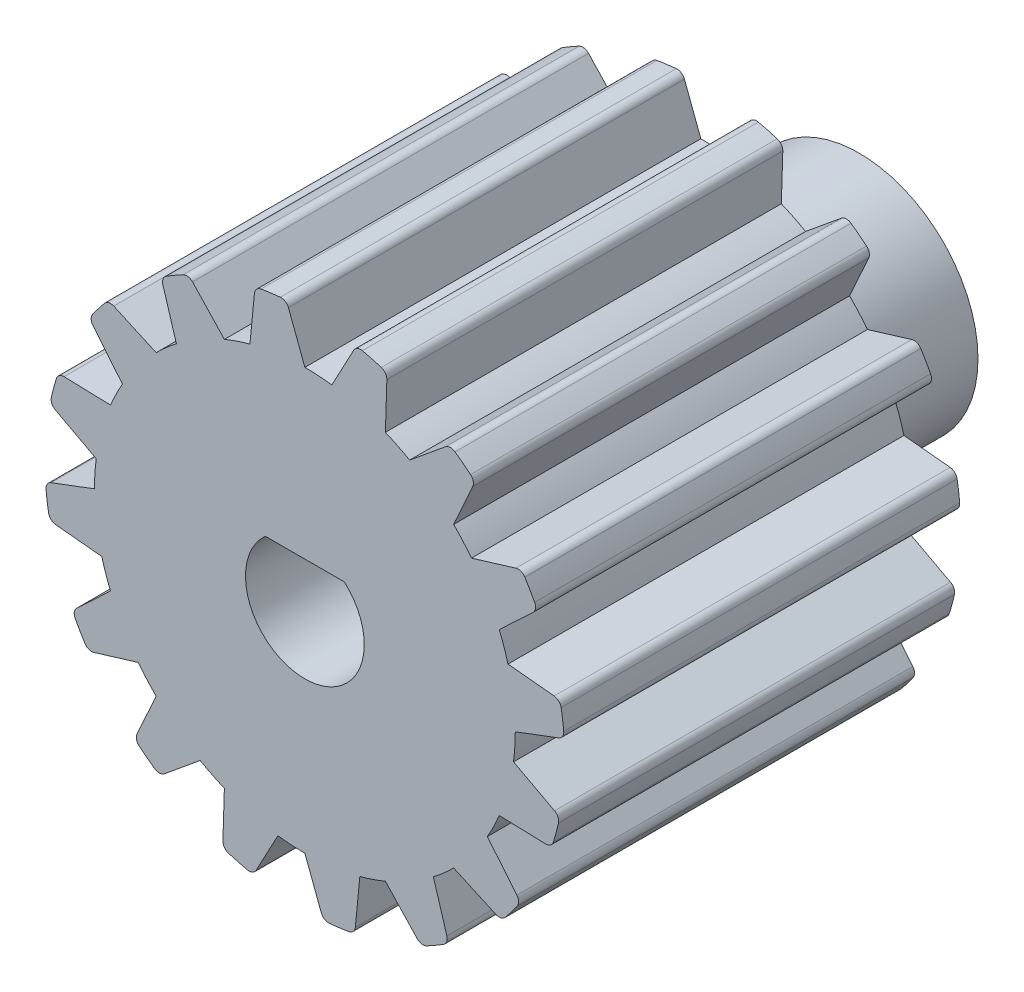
from build123d import *

# Parameters (mm, degrees)
SALIENTE_EXTRUIR1_DEPTH = 15
CROQUIS5_R              = 4.5
SALIENTE_EXTRUIR2_DEPTH = 6
CORTAR_EXTRUIR1_DEPTH   = 26.166810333


with BuildPart() as part:
    # Croquis2 → Saliente-Extruir1 (new body)
    with BuildSketch(Plane.XY):
        with BuildLine():
            Line((-2.081696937, 7.693567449), (-1.911179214, 9.445287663))
            ThreePointArc((-1.911179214, 9.445287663), (-1.831468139, 9.618345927), (-1.663611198, 9.708496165))
            ThreePointArc((-1.663611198, 9.708496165), (-1.297642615, 9.764149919), (-0.929841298, 9.806013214))
            ThreePointArc((-0.929841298, 9.806013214), (-0.744265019, 9.762833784), (-0.622120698, 9.616601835))
            Line((-0.622120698, 9.616601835), (0, 7.97022222))
            ThreePointArc((0, 7.97022222), (0.511536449, 7.953789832), (1.020963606, 7.904560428))
            Line((1.020963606, 7.904560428), (1.848855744, 9.457684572))
            ThreePointArc((1.848855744, 9.457684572), (1.988725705, 9.587065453), (2.1783043, 9.606117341))
            ThreePointArc((2.1783043, 9.606117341), (2.537712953, 9.517484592), (2.893537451, 9.415409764))
            ThreePointArc((2.893537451, 9.415409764), (3.048463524, 9.304500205), (3.105349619, 9.122656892))
            Line((3.105349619, 9.122656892), (3.050071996, 7.363525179))
            ThreePointArc((3.050071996, 7.363525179), (3.516381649, 7.152587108), (3.968191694, 6.912155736))
            Line((3.968191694, 6.912155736), (5.327419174, 8.030234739))
            ThreePointArc((5.327419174, 8.030234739), (5.506154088, 8.09624117), (5.688592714, 8.041294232))
            ThreePointArc((5.688592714, 8.041294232), (5.986724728, 7.821868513), (6.276401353, 7.591395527))
            ThreePointArc((6.276401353, 7.591395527), (6.37709113, 7.429640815), (6.360058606, 7.239870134))
            Line((6.360058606, 7.239870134), (5.635798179, 5.635798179))
            ThreePointArc((5.635798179, 5.635798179), (5.985889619, 5.262467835), (6.311298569, 4.867437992))
            Line((6.311298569, 4.867437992), (7.994931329, 5.380254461))
            ThreePointArc((7.994931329, 5.380254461), (8.185320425, 5.372837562), (8.332844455, 5.252256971))
            ThreePointArc((8.332844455, 5.252256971), (8.524311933, 4.935443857), (8.703740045, 4.611660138))
            ThreePointArc((8.703740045, 4.611660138), (8.73486442, 4.42368596), (8.646506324, 4.254878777))
            Line((8.646506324, 4.254878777), (7.363525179, 3.050071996))
            ThreePointArc((7.363525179, 3.050071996), (7.544100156, 2.571185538), (7.693567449, 2.081696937))
            Line((7.693567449, 2.081696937), (9.445287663, 1.911179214))
            ThreePointArc((9.445287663, 1.911179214), (9.618345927, 1.831468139), (9.708496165, 1.663611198))
            ThreePointArc((9.708496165, 1.663611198), (9.764149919, 1.297642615), (9.806013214, 0.929841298))
            ThreePointArc((9.806013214, 0.929841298), (9.762833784, 0.744265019), (9.616601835, 0.622120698))
            Line((9.616601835, 0.622120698), (7.97022222, 0))
            ThreePointArc((7.97022222, 0), (7.953789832, -0.511536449), (7.904560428, -1.020963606))
            Line((7.904560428, -1.020963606), (9.457684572, -1.848855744))
            ThreePointArc((9.457684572, -1.848855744), (9.587065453, -1.988725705), (9.606117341, -2.1783043))
            ThreePointArc((9.606117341, -2.1783043), (9.517484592, -2.537712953), (9.415409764, -2.893537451))
            ThreePointArc((9.415409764, -2.893537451), (9.304500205, -3.048463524), (9.122656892, -3.105349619))
            Line((9.122656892, -3.105349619), (7.363525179, -3.050071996))
            ThreePointArc((7.363525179, -3.050071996), (7.152587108, -3.516381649), (6.912155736, -3.968191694))
            Line((6.912155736, -3.968191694), (8.030234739, -5.327419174))
            ThreePointArc((8.030234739, -5.327419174), (8.09624117, -5.506154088), (8.041294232, -5.688592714))
            ThreePointArc((8.041294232, -5.688592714), (7.821868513, -5.986724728), (7.591395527, -6.276401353))
            ThreePointArc((7.591395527, -6.276401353), (7.429640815, -6.37709113), (7.239870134, -6.360058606))
            Line((7.239870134, -6.360058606), (5.635798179, -5.635798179))
            ThreePointArc((5.635798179, -5.635798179), (5.262467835, -5.985889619), (4.867437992, -6.311298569))
            Line((4.867437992, -6.311298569), (5.380254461, -7.994931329))
            ThreePointArc((5.380254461, -7.994931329), (5.372837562, -8.185320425), (5.252256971, -8.332844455))
            ThreePointArc((5.252256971, -8.332844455), (4.935443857, -8.524311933), (4.611660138, -8.703740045))
            ThreePointArc((4.611660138, -8.703740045), (4.42368596, -8.73486442), (4.254878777, -8.646506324))
            Line((4.254878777, -8.646506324), (3.050071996, -7.363525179))
            ThreePointArc((3.050071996, -7.363525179), (2.571185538, -7.544100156), (2.081696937, -7.693567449))
            Line((2.081696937, -7.693567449), (1.911179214, -9.445287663))
            ThreePointArc((1.911179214, -9.445287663), (1.831468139, -9.618345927), (1.663611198, -9.708496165))
            ThreePointArc((1.663611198, -9.708496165), (1.297642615, -9.764149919), (0.929841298, -9.806013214))
            ThreePointArc((0.929841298, -9.806013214), (0.744265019, -9.762833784), (0.622120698, -9.616601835))
            Line((0.622120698, -9.616601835), (0, -7.97022222))
            ThreePointArc((0, -7.97022222), (-0.511536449, -7.953789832), (-1.020963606, -7.904560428))
            Line((-1.020963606, -7.904560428), (-1.848855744, -9.457684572))
            ThreePointArc((-1.848855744, -9.457684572), (-1.988725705, -9.587065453), (-2.1783043, -9.606117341))
            ThreePointArc((-2.1783043, -9.606117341), (-2.537712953, -9.517484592), (-2.893537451, -9.415409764))
            ThreePointArc((-2.893537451, -9.415409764), (-3.048463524, -9.304500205), (-3.105349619, -9.122656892))
            Line((-3.105349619, -9.122656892), (-3.050071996, -7.363525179))
            ThreePointArc((-3.050071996, -7.363525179), (-3.516381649, -7.152587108), (-3.968191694, -6.912155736))
            Line((-3.968191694, -6.912155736), (-5.327419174, -8.030234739))
            ThreePointArc((-5.327419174, -8.030234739), (-5.506154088, -8.09624117), (-5.688592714, -8.041294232))
            ThreePointArc((-5.688592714, -8.041294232), (-5.986724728, -7.821868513), (-6.276401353, -7.591395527))
            ThreePointArc((-6.276401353, -7.591395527), (-6.37709113, -7.429640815), (-6.360058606, -7.239870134))
            Line((-6.360058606, -7.239870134), (-5.635798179, -5.635798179))
            ThreePointArc((-5.635798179, -5.635798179), (-5.985889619, -5.262467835), (-6.311298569, -4.867437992))
            Line((-6.311298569, -4.867437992), (-7.994931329, -5.380254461))
            ThreePointArc((-7.994931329, -5.380254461), (-8.185320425, -5.372837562), (-8.332844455, -5.252256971))
            ThreePointArc((-8.332844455, -5.252256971), (-8.524311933, -4.935443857), (-8.703740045, -4.611660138))
            ThreePointArc((-8.703740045, -4.611660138), (-8.73486442, -4.42368596), (-8.646506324, -4.254878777))
            Line((-8.646506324, -4.254878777), (-7.363525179, -3.050071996))
            ThreePointArc((-7.363525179, -3.050071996), (-7.544100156, -2.571185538), (-7.693567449, -2.081696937))
            Line((-7.693567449, -2.081696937), (-9.445287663, -1.911179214))
            ThreePointArc((-9.445287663, -1.911179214), (-9.618345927, -1.831468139), (-9.708496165, -1.663611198))
            ThreePointArc((-9.708496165, -1.663611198), (-9.764149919, -1.297642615), (-9.806013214, -0.929841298))
            ThreePointArc((-9.806013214, -0.929841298), (-9.762833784, -0.744265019), (-9.616601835, -0.622120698))
            Line((-9.616601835, -0.622120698), (-7.97022222, 0))
            ThreePointArc((-7.97022222, 0), (-7.953789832, 0.511536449), (-7.904560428, 1.020963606))
            Line((-7.904560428, 1.020963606), (-9.457684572, 1.848855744))
            ThreePointArc((-9.457684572, 1.848855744), (-9.587065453, 1.988725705), (-9.606117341, 2.1783043))
            ThreePointArc((-9.606117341, 2.1783043), (-9.517484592, 2.537712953), (-9.415409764, 2.893537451))
            ThreePointArc((-9.415409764, 2.893537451), (-9.304500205, 3.048463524), (-9.122656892, 3.105349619))
            Line((-9.122656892, 3.105349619), (-7.363525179, 3.050071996))
            ThreePointArc((-7.363525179, 3.050071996), (-7.152587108, 3.516381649), (-6.912155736, 3.968191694))
            Line((-6.912155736, 3.968191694), (-8.030234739, 5.327419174))
            ThreePointArc((-8.030234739, 5.327419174), (-8.09624117, 5.506154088), (-8.041294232, 5.688592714))
            ThreePointArc((-8.041294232, 5.688592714), (-7.821868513, 5.986724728), (-7.591395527, 6.276401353))
            ThreePointArc((-7.591395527, 6.276401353), (-7.429640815, 6.37709113), (-7.239870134, 6.360058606))
            Line((-7.239870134, 6.360058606), (-5.635798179, 5.635798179))
            ThreePointArc((-5.635798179, 5.635798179), (-5.262467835, 5.985889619), (-4.867437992, 6.311298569))
            Line((-4.867437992, 6.311298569), (-5.380254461, 7.994931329))
            ThreePointArc((-5.380254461, 7.994931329), (-5.372837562, 8.185320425), (-5.252256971, 8.332844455))
            ThreePointArc((-5.252256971, 8.332844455), (-4.935443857, 8.524311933), (-4.611660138, 8.703740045))
            ThreePointArc((-4.611660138, 8.703740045), (-4.42368596, 8.73486442), (-4.254878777, 8.646506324))
            Line((-4.254878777, 8.646506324), (-3.050071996, 7.363525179))
            ThreePointArc((-3.050071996, 7.363525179), (-2.571185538, 7.544100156), (-2.081696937, 7.693567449))
        make_face()
    extrude(amount=SALIENTE_EXTRUIR1_DEPTH)

    # Croquis5 → Saliente-Extruir2 (add)
    with BuildSketch(Plane(origin=(0, 0, 0), x_dir=(-1, 0, 0), z_dir=(0, 0, -1))):
        with Locations(Location((0, 0, 0), (0, 0, 180))):
            Circle(CROQUIS5_R)
    extrude(amount=SALIENTE_EXTRUIR2_DEPTH)

    # Croquis3 → Cortar-Extruir1 (cut, through all)
    with BuildSketch(Plane.XY.offset(15)):
        with BuildLine():
            Line((-1.496696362, 1.68), (1.496696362, 1.68))
            ThreePointArc((1.496696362, 1.68), (0, -2.25), (-1.496696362, 1.68))
        make_face()
    extrude(amount=-CORTAR_EXTRUIR1_DEPTH, mode=Mode.SUBTRACT)


solid = part.part
